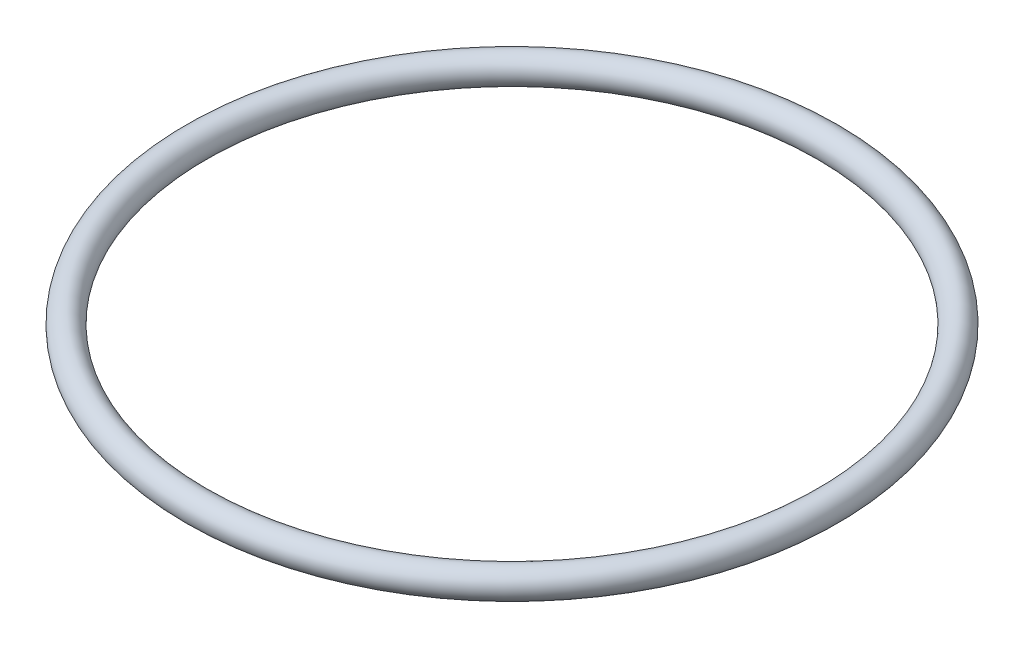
from build123d import *

# Parameters (mm, degrees)
SKETCH1_R = 0.889


with BuildPart() as part:
    # Sketch1 → Revolve1 (revolve)
    with BuildSketch(Plane.XY, mode=Mode.PRIVATE) as revolve1_sk:
        with Locations((19.7993, 0)):
            Circle(SKETCH1_R)
    revolve(revolve1_sk.sketch.rotate(Axis((0, 3.724897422, 0), (0, -1, 0)), 90), axis=Axis((0, 3.724897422, 0), (0, -1, 0)))


solid = part.part
